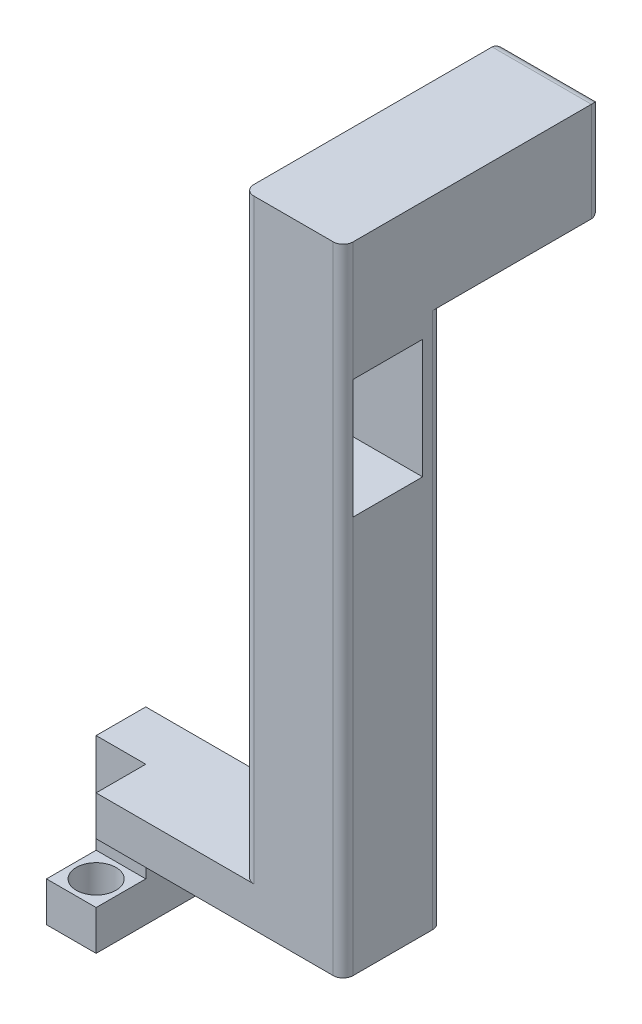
ISO-10303-21;
HEADER;
FILE_DESCRIPTION(('STEP AP214'),'2;1');
FILE_NAME('part.step','',(''),(''),'','','');
FILE_SCHEMA(('AUTOMOTIVE_DESIGN { 1 0 10303 214 1 1 1 1 }'));
ENDSEC;
DATA;
#1=APPLICATION_CONTEXT('core data for automotive mechanical design processes');
#2=APPLICATION_PROTOCOL_DEFINITION('international standard','automotive_design',2000,#1);
#3=PRODUCT_CONTEXT('',#1,'mechanical');
#4=PRODUCT('Part','Part','',(#3));
#5=PRODUCT_RELATED_PRODUCT_CATEGORY('part','',(#4));
#6=PRODUCT_DEFINITION_FORMATION('','',#4);
#7=PRODUCT_DEFINITION_CONTEXT('part definition',#1,'design');
#8=PRODUCT_DEFINITION('design','',#6,#7);
#9=PRODUCT_DEFINITION_SHAPE('','',#8);
#10=(LENGTH_UNIT() NAMED_UNIT(*) SI_UNIT(.MILLI.,.METRE.));
#11=(NAMED_UNIT(*) PLANE_ANGLE_UNIT() SI_UNIT($,.RADIAN.));
#12=(NAMED_UNIT(*) SI_UNIT($,.STERADIAN.) SOLID_ANGLE_UNIT());
#13=UNCERTAINTY_MEASURE_WITH_UNIT(LENGTH_MEASURE(1.E-05),#10,'distance_accuracy_value','');
#14=(GEOMETRIC_REPRESENTATION_CONTEXT(3) GLOBAL_UNCERTAINTY_ASSIGNED_CONTEXT((#13)) GLOBAL_UNIT_ASSIGNED_CONTEXT((#10,
#11,#12)) REPRESENTATION_CONTEXT('',''));
#15=CARTESIAN_POINT('',(0.,0.,0.));
#16=DIRECTION('',(0.,0.,1.));
#17=DIRECTION('',(1.,0.,0.));
#18=AXIS2_PLACEMENT_3D('',#15,#16,#17);
#19=CARTESIAN_POINT('',(-7.47,2.,-2.5));
#20=DIRECTION('',(1.,0.,0.));
#21=DIRECTION('',(0.,0.,-1.));
#22=AXIS2_PLACEMENT_3D('',#19,#20,#21);
#23=PLANE('',#22);
#24=DIRECTION('',(0.,0.,-1.));
#25=VECTOR('',#24,1.);
#26=CARTESIAN_POINT('',(-7.47,-3.,0.));
#27=LINE('',#26,#25);
#28=CARTESIAN_POINT('',(-7.47,-3.,2.5));
#29=VERTEX_POINT('',#28);
#30=CARTESIAN_POINT('',(-7.47,-3.,0.));
#31=VERTEX_POINT('',#30);
#32=EDGE_CURVE('E222',#29,#31,#27,.T.);
#33=ORIENTED_EDGE('',*,*,#32,.T.);
#34=DIRECTION('',(0.,-1.,0.));
#35=VECTOR('',#34,1.);
#36=CARTESIAN_POINT('',(-7.47,0.,0.));
#37=LINE('',#36,#35);
#38=CARTESIAN_POINT('',(-7.47,2.,0.));
#39=VERTEX_POINT('',#38);
#40=EDGE_CURVE('E610',#39,#31,#37,.T.);
#41=ORIENTED_EDGE('',*,*,#40,.F.);
#42=DIRECTION('',(0.,0.,1.));
#43=VECTOR('',#42,1.);
#44=CARTESIAN_POINT('',(-7.47,2.,-2.5));
#45=LINE('',#44,#43);
#46=CARTESIAN_POINT('',(-7.47,2.,-2.5));
#47=VERTEX_POINT('',#46);
#48=EDGE_CURVE('E227',#47,#39,#45,.T.);
#49=ORIENTED_EDGE('',*,*,#48,.F.);
#50=DIRECTION('',(0.,-1.,0.));
#51=VECTOR('',#50,1.);
#52=CARTESIAN_POINT('',(-7.47,2.,-2.5));
#53=LINE('',#52,#51);
#54=CARTESIAN_POINT('',(-7.47,-5.,-2.5));
#55=VERTEX_POINT('',#54);
#56=EDGE_CURVE('E354',#47,#55,#53,.T.);
#57=ORIENTED_EDGE('',*,*,#56,.T.);
#58=DIRECTION('',(0.,0.,-1.));
#59=VECTOR('',#58,1.);
#60=CARTESIAN_POINT('',(-7.47,-5.,0.));
#61=LINE('',#60,#59);
#62=CARTESIAN_POINT('',(-7.47,-5.,2.5));
#63=VERTEX_POINT('',#62);
#64=EDGE_CURVE('E248',#63,#55,#61,.T.);
#65=ORIENTED_EDGE('',*,*,#64,.F.);
#66=DIRECTION('',(0.,-1.,0.));
#67=VECTOR('',#66,1.);
#68=CARTESIAN_POINT('',(-7.47,2.,2.5));
#69=LINE('',#68,#67);
#70=EDGE_CURVE('E343',#29,#63,#69,.T.);
#71=ORIENTED_EDGE('',*,*,#70,.F.);
#72=EDGE_LOOP('',(#33,#41,#49,#57,#65,#71));
#73=FACE_BOUND('',#72,.T.);
#74=ADVANCED_FACE('F45',(#73),#23,.F.);
#75=CARTESIAN_POINT('',(-7.47,2.,2.5));
#76=DIRECTION('',(0.,0.,-1.));
#77=DIRECTION('',(-1.,0.,0.));
#78=AXIS2_PLACEMENT_3D('',#75,#76,#77);
#79=PLANE('',#78);
#80=DIRECTION('',(-1.,0.,0.));
#81=VECTOR('',#80,1.);
#82=CARTESIAN_POINT('',(-4.97,-3.,2.5));
#83=LINE('',#82,#81);
#84=CARTESIAN_POINT('',(-4.97,-3.,2.5));
#85=VERTEX_POINT('',#84);
#86=EDGE_CURVE('E232',#85,#29,#83,.T.);
#87=ORIENTED_EDGE('',*,*,#86,.T.);
#88=ORIENTED_EDGE('',*,*,#70,.T.);
#89=DIRECTION('',(-1.,0.,0.));
#90=VECTOR('',#89,1.);
#91=CARTESIAN_POINT('',(0.,-5.,2.5));
#92=LINE('',#91,#90);
#93=CARTESIAN_POINT('',(-4.97,-5.,2.5));
#94=VERTEX_POINT('',#93);
#95=EDGE_CURVE('E244',#94,#63,#92,.T.);
#96=ORIENTED_EDGE('',*,*,#95,.F.);
#97=DIRECTION('',(0.,1.,0.));
#98=VECTOR('',#97,1.);
#99=CARTESIAN_POINT('',(-4.97,-5.,2.5));
#100=LINE('',#99,#98);
#101=EDGE_CURVE('E252',#94,#85,#100,.T.);
#102=ORIENTED_EDGE('',*,*,#101,.T.);
#103=EDGE_LOOP('',(#87,#88,#96,#102));
#104=FACE_BOUND('',#103,.T.);
#105=ADVANCED_FACE('F530',(#104),#79,.F.);
#106=DIRECTION('',(0.,1.,0.));
#107=VECTOR('',#106,1.);
#108=CARTESIAN_POINT('',(-4.97,0.,2.5));
#109=LINE('',#108,#107);
#110=CARTESIAN_POINT('',(-4.97,0.,2.5));
#111=VERTEX_POINT('',#110);
#112=CARTESIAN_POINT('',(-4.97,2.,2.5));
#113=VERTEX_POINT('',#112);
#114=EDGE_CURVE('E218',#111,#113,#109,.T.);
#115=ORIENTED_EDGE('',*,*,#114,.F.);
#116=DIRECTION('',(1.,0.,0.));
#117=VECTOR('',#116,1.);
#118=CARTESIAN_POINT('',(-7.47,0.,2.5));
#119=LINE('',#118,#117);
#120=CARTESIAN_POINT('',(6.97,0.,2.5));
#121=VERTEX_POINT('',#120);
#122=EDGE_CURVE('E337',#111,#121,#119,.T.);
#123=ORIENTED_EDGE('',*,*,#122,.T.);
#124=DIRECTION('',(0.,-1.,0.));
#125=VECTOR('',#124,1.);
#126=CARTESIAN_POINT('',(6.97,2.,2.5));
#127=LINE('',#126,#125);
#128=CARTESIAN_POINT('',(6.97,32.,2.5));
#129=VERTEX_POINT('',#128);
#130=EDGE_CURVE('E425',#121,#129,#127,.F.);
#131=ORIENTED_EDGE('',*,*,#130,.T.);
#132=DIRECTION('',(1.,0.,0.));
#133=VECTOR('',#132,1.);
#134=CARTESIAN_POINT('',(0.,32.,2.5));
#135=LINE('',#134,#133);
#136=CARTESIAN_POINT('',(2.97,32.,2.5));
#137=VERTEX_POINT('',#136);
#138=EDGE_CURVE('E322',#137,#129,#135,.T.);
#139=ORIENTED_EDGE('',*,*,#138,.F.);
#140=DIRECTION('',(0.,-1.,0.));
#141=VECTOR('',#140,1.);
#142=CARTESIAN_POINT('',(2.97,2.,2.5));
#143=LINE('',#142,#141);
#144=CARTESIAN_POINT('',(2.97,2.,2.5));
#145=VERTEX_POINT('',#144);
#146=EDGE_CURVE('E421',#137,#145,#143,.T.);
#147=ORIENTED_EDGE('',*,*,#146,.T.);
#148=DIRECTION('',(1.,0.,0.));
#149=VECTOR('',#148,1.);
#150=CARTESIAN_POINT('',(-7.47,2.,2.5));
#151=LINE('',#150,#149);
#152=EDGE_CURVE('E340',#113,#145,#151,.T.);
#153=ORIENTED_EDGE('',*,*,#152,.F.);
#154=EDGE_LOOP('',(#115,#123,#131,#139,#147,#153));
#155=FACE_BOUND('',#154,.T.);
#156=ADVANCED_FACE('F497',(#155),#79,.F.);
#157=CARTESIAN_POINT('',(-4.97,-5.,0.));
#158=DIRECTION('',(-1.,0.,0.));
#159=DIRECTION('',(0.,0.,1.));
#160=AXIS2_PLACEMENT_3D('',#157,#158,#159);
#161=PLANE('',#160);
#162=DIRECTION('',(0.,0.,-1.));
#163=VECTOR('',#162,1.);
#164=CARTESIAN_POINT('',(-4.97,-3.,0.));
#165=LINE('',#164,#163);
#166=CARTESIAN_POINT('',(-4.97,-3.,0.));
#167=VERTEX_POINT('',#166);
#168=EDGE_CURVE('E212',#85,#167,#165,.T.);
#169=ORIENTED_EDGE('',*,*,#168,.F.);
#170=ORIENTED_EDGE('',*,*,#101,.F.);
#171=DIRECTION('',(0.,0.,1.));
#172=VECTOR('',#171,1.);
#173=CARTESIAN_POINT('',(-4.97,-5.,0.));
#174=LINE('',#173,#172);
#175=CARTESIAN_POINT('',(-4.97,-5.,-2.5));
#176=VERTEX_POINT('',#175);
#177=EDGE_CURVE('E241',#176,#94,#174,.T.);
#178=ORIENTED_EDGE('',*,*,#177,.F.);
#179=DIRECTION('',(0.,1.,0.));
#180=VECTOR('',#179,1.);
#181=CARTESIAN_POINT('',(-4.97,-5.,-2.5));
#182=LINE('',#181,#180);
#183=CARTESIAN_POINT('',(-4.97,0.,-2.5));
#184=VERTEX_POINT('',#183);
#185=EDGE_CURVE('E259',#176,#184,#182,.T.);
#186=ORIENTED_EDGE('',*,*,#185,.T.);
#187=DIRECTION('',(0.,0.,1.));
#188=VECTOR('',#187,1.);
#189=CARTESIAN_POINT('',(-4.97,0.,0.));
#190=LINE('',#189,#188);
#191=CARTESIAN_POINT('',(-4.97,0.,0.));
#192=VERTEX_POINT('',#191);
#193=EDGE_CURVE('E69',#184,#192,#190,.T.);
#194=ORIENTED_EDGE('',*,*,#193,.T.);
#195=DIRECTION('',(0.,-1.,0.));
#196=VECTOR('',#195,1.);
#197=CARTESIAN_POINT('',(-4.97,-5.,0.));
#198=LINE('',#197,#196);
#199=EDGE_CURVE('E11',#192,#167,#198,.T.);
#200=ORIENTED_EDGE('',*,*,#199,.T.);
#201=EDGE_LOOP('',(#169,#170,#178,#186,#194,#200));
#202=FACE_BOUND('',#201,.T.);
#203=ADVANCED_FACE('F580',(#202),#161,.F.);
#204=CARTESIAN_POINT('',(0.,0.,0.));
#205=DIRECTION('',(0.,1.,0.));
#206=DIRECTION('',(0.,0.,1.));
#207=AXIS2_PLACEMENT_3D('',#204,#205,#206);
#208=PLANE('',#207);
#209=ORIENTED_EDGE('',*,*,#193,.F.);
#210=DIRECTION('',(-1.,0.,0.));
#211=VECTOR('',#210,1.);
#212=CARTESIAN_POINT('',(-7.47,0.,-2.5));
#213=LINE('',#212,#211);
#214=CARTESIAN_POINT('',(6.97,0.,-2.5));
#215=VERTEX_POINT('',#214);
#216=EDGE_CURVE('E347',#215,#184,#213,.T.);
#217=ORIENTED_EDGE('',*,*,#216,.F.);
#218=CARTESIAN_POINT('',(6.97,0.,-2.));
#219=DIRECTION('',(0.,1.,0.));
#220=DIRECTION('',(0.,0.,1.));
#221=AXIS2_PLACEMENT_3D('',#218,#219,#220);
#222=CIRCLE('',#221,0.5);
#223=CARTESIAN_POINT('',(7.47,0.,-2.));
#224=VERTEX_POINT('',#223);
#225=EDGE_CURVE('E418',#215,#224,#222,.F.);
#226=ORIENTED_EDGE('',*,*,#225,.T.);
#227=DIRECTION('',(0.,0.,-1.));
#228=VECTOR('',#227,1.);
#229=CARTESIAN_POINT('',(7.47,0.,-2.5));
#230=LINE('',#229,#228);
#231=CARTESIAN_POINT('',(7.47,0.,2.));
#232=VERTEX_POINT('',#231);
#233=EDGE_CURVE('E330',#232,#224,#230,.T.);
#234=ORIENTED_EDGE('',*,*,#233,.F.);
#235=CARTESIAN_POINT('',(6.97,0.,2.));
#236=DIRECTION('',(0.,1.,0.));
#237=DIRECTION('',(0.,0.,1.));
#238=AXIS2_PLACEMENT_3D('',#235,#236,#237);
#239=CIRCLE('',#238,0.5);
#240=EDGE_CURVE('E414',#232,#121,#239,.F.);
#241=ORIENTED_EDGE('',*,*,#240,.T.);
#242=ORIENTED_EDGE('',*,*,#122,.F.);
#243=EDGE_CURVE('E255',#192,#111,#190,.T.);
#244=ORIENTED_EDGE('',*,*,#243,.F.);
#245=EDGE_LOOP('',(#209,#217,#226,#234,#241,#242,#244));
#246=FACE_BOUND('',#245,.T.);
#247=ADVANCED_FACE('F545',(#246),#208,.F.);
#248=CARTESIAN_POINT('',(7.47,2.,-2.5));
#249=DIRECTION('',(-1.,0.,0.));
#250=DIRECTION('',(0.,0.,1.));
#251=AXIS2_PLACEMENT_3D('',#248,#249,#250);
#252=PLANE('',#251);
#253=DIRECTION('',(0.,0.,1.));
#254=VECTOR('',#253,1.);
#255=CARTESIAN_POINT('',(7.47,26.,-2.5));
#256=LINE('',#255,#254);
#257=CARTESIAN_POINT('',(7.47,26.,-1.5));
#258=VERTEX_POINT('',#257);
#259=CARTESIAN_POINT('',(7.47,26.,2.));
#260=VERTEX_POINT('',#259);
#261=EDGE_CURVE('E298',#258,#260,#256,.T.);
#262=ORIENTED_EDGE('',*,*,#261,.F.);
#263=DIRECTION('',(0.,1.,0.));
#264=VECTOR('',#263,1.);
#265=CARTESIAN_POINT('',(7.47,2.,-1.5));
#266=LINE('',#265,#264);
#267=CARTESIAN_POINT('',(7.47,20.,-1.5));
#268=VERTEX_POINT('',#267);
#269=EDGE_CURVE('E302',#268,#258,#266,.T.);
#270=ORIENTED_EDGE('',*,*,#269,.F.);
#271=DIRECTION('',(0.,0.,1.));
#272=VECTOR('',#271,1.);
#273=CARTESIAN_POINT('',(7.47,20.,-2.5));
#274=LINE('',#273,#272);
#275=CARTESIAN_POINT('',(7.47,20.,2.));
#276=VERTEX_POINT('',#275);
#277=EDGE_CURVE('E282',#268,#276,#274,.T.);
#278=ORIENTED_EDGE('',*,*,#277,.T.);
#279=DIRECTION('',(0.,-1.,0.));
#280=VECTOR('',#279,1.);
#281=CARTESIAN_POINT('',(7.47,2.,2.));
#282=LINE('',#281,#280);
#283=EDGE_CURVE('E395',#276,#232,#282,.T.);
#284=ORIENTED_EDGE('',*,*,#283,.T.);
#285=ORIENTED_EDGE('',*,*,#233,.T.);
#286=DIRECTION('',(0.,-1.,0.));
#287=VECTOR('',#286,1.);
#288=CARTESIAN_POINT('',(7.47,2.,-2.));
#289=LINE('',#288,#287);
#290=CARTESIAN_POINT('',(7.47,27.,-2.));
#291=VERTEX_POINT('',#290);
#292=EDGE_CURVE('E400',#224,#291,#289,.F.);
#293=ORIENTED_EDGE('',*,*,#292,.T.);
#294=DIRECTION('',(0.,0.,1.));
#295=VECTOR('',#294,1.);
#296=CARTESIAN_POINT('',(7.47,27.,-10.5));
#297=LINE('',#296,#295);
#298=CARTESIAN_POINT('',(7.47,27.,-10.));
#299=VERTEX_POINT('',#298);
#300=EDGE_CURVE('E314',#299,#291,#297,.T.);
#301=ORIENTED_EDGE('',*,*,#300,.F.);
#302=DIRECTION('',(0.,-1.,0.));
#303=VECTOR('',#302,1.);
#304=CARTESIAN_POINT('',(7.47,32.,-10.));
#305=LINE('',#304,#303);
#306=CARTESIAN_POINT('',(7.47,32.,-10.));
#307=VERTEX_POINT('',#306);
#308=EDGE_CURVE('E404',#299,#307,#305,.F.);
#309=ORIENTED_EDGE('',*,*,#308,.T.);
#310=DIRECTION('',(0.,0.,-1.));
#311=VECTOR('',#310,1.);
#312=CARTESIAN_POINT('',(7.47,32.,0.));
#313=LINE('',#312,#311);
#314=CARTESIAN_POINT('',(7.47,32.,2.));
#315=VERTEX_POINT('',#314);
#316=EDGE_CURVE('E326',#315,#307,#313,.T.);
#317=ORIENTED_EDGE('',*,*,#316,.F.);
#318=EDGE_CURVE('E396',#315,#260,#282,.T.);
#319=ORIENTED_EDGE('',*,*,#318,.T.);
#320=EDGE_LOOP('',(#262,#270,#278,#284,#285,#293,#301,#309,#317,#319));
#321=FACE_BOUND('',#320,.T.);
#322=ADVANCED_FACE('F469',(#321),#252,.F.);
#323=CARTESIAN_POINT('',(2.47,32.,0.));
#324=DIRECTION('',(-1.,0.,0.));
#325=DIRECTION('',(0.,0.,1.));
#326=AXIS2_PLACEMENT_3D('',#323,#324,#325);
#327=PLANE('',#326);
#328=DIRECTION('',(0.,1.,0.));
#329=VECTOR('',#328,1.);
#330=CARTESIAN_POINT('',(2.47,0.,-1.5));
#331=LINE('',#330,#329);
#332=CARTESIAN_POINT('',(2.47,20.,-1.5));
#333=VERTEX_POINT('',#332);
#334=CARTESIAN_POINT('',(2.47,26.,-1.5));
#335=VERTEX_POINT('',#334);
#336=EDGE_CURVE('E267',#333,#335,#331,.T.);
#337=ORIENTED_EDGE('',*,*,#336,.T.);
#338=DIRECTION('',(0.,0.,1.));
#339=VECTOR('',#338,1.);
#340=CARTESIAN_POINT('',(2.47,26.,0.));
#341=LINE('',#340,#339);
#342=CARTESIAN_POINT('',(2.47,26.,2.));
#343=VERTEX_POINT('',#342);
#344=EDGE_CURVE('E263',#335,#343,#341,.T.);
#345=ORIENTED_EDGE('',*,*,#344,.T.);
#346=DIRECTION('',(0.,-1.,0.));
#347=VECTOR('',#346,1.);
#348=CARTESIAN_POINT('',(2.47,32.,2.));
#349=LINE('',#348,#347);
#350=CARTESIAN_POINT('',(2.47,32.,2.));
#351=VERTEX_POINT('',#350);
#352=EDGE_CURVE('E380',#343,#351,#349,.F.);
#353=ORIENTED_EDGE('',*,*,#352,.T.);
#354=DIRECTION('',(0.,0.,-1.));
#355=VECTOR('',#354,1.);
#356=CARTESIAN_POINT('',(2.47,32.,0.));
#357=LINE('',#356,#355);
#358=CARTESIAN_POINT('',(2.47,32.,-10.));
#359=VERTEX_POINT('',#358);
#360=EDGE_CURVE('E318',#351,#359,#357,.T.);
#361=ORIENTED_EDGE('',*,*,#360,.T.);
#362=DIRECTION('',(0.,1.,0.));
#363=VECTOR('',#362,1.);
#364=CARTESIAN_POINT('',(2.47,32.,-10.));
#365=LINE('',#364,#363);
#366=CARTESIAN_POINT('',(2.47,27.,-10.));
#367=VERTEX_POINT('',#366);
#368=EDGE_CURVE('E389',#359,#367,#365,.F.);
#369=ORIENTED_EDGE('',*,*,#368,.T.);
#370=DIRECTION('',(0.,0.,1.));
#371=VECTOR('',#370,1.);
#372=CARTESIAN_POINT('',(2.47,27.,-10.5));
#373=LINE('',#372,#371);
#374=CARTESIAN_POINT('',(2.47,27.,-2.));
#375=VERTEX_POINT('',#374);
#376=EDGE_CURVE('E310',#367,#375,#373,.T.);
#377=ORIENTED_EDGE('',*,*,#376,.T.);
#378=DIRECTION('',(0.,-1.,0.));
#379=VECTOR('',#378,1.);
#380=CARTESIAN_POINT('',(2.47,2.,-2.));
#381=LINE('',#380,#379);
#382=CARTESIAN_POINT('',(2.47,2.,-2.));
#383=VERTEX_POINT('',#382);
#384=EDGE_CURVE('E385',#375,#383,#381,.T.);
#385=ORIENTED_EDGE('',*,*,#384,.T.);
#386=DIRECTION('',(0.,0.,-1.));
#387=VECTOR('',#386,1.);
#388=CARTESIAN_POINT('',(2.47,2.,0.));
#389=LINE('',#388,#387);
#390=CARTESIAN_POINT('',(2.47,2.,2.));
#391=VERTEX_POINT('',#390);
#392=EDGE_CURVE('E317',#391,#383,#389,.T.);
#393=ORIENTED_EDGE('',*,*,#392,.F.);
#394=CARTESIAN_POINT('',(2.47,20.,2.));
#395=VERTEX_POINT('',#394);
#396=EDGE_CURVE('E381',#391,#395,#349,.F.);
#397=ORIENTED_EDGE('',*,*,#396,.T.);
#398=DIRECTION('',(0.,0.,1.));
#399=VECTOR('',#398,1.);
#400=CARTESIAN_POINT('',(2.47,20.,0.));
#401=LINE('',#400,#399);
#402=EDGE_CURVE('E271',#333,#395,#401,.T.);
#403=ORIENTED_EDGE('',*,*,#402,.F.);
#404=EDGE_LOOP('',(#337,#345,#353,#361,#369,#377,#385,#393,#397,#403));
#405=FACE_BOUND('',#404,.T.);
#406=ADVANCED_FACE('F488',(#405),#327,.T.);
#407=CARTESIAN_POINT('',(-7.47,2.,-2.5));
#408=DIRECTION('',(0.,0.,1.));
#409=DIRECTION('',(1.,0.,0.));
#410=AXIS2_PLACEMENT_3D('',#407,#408,#409);
#411=PLANE('',#410);
#412=DIRECTION('',(-1.,0.,0.));
#413=VECTOR('',#412,1.);
#414=CARTESIAN_POINT('',(0.,27.,-2.5));
#415=LINE('',#414,#413);
#416=CARTESIAN_POINT('',(6.97,27.,-2.5));
#417=VERTEX_POINT('',#416);
#418=CARTESIAN_POINT('',(2.97,27.,-2.5));
#419=VERTEX_POINT('',#418);
#420=EDGE_CURVE('E306',#417,#419,#415,.T.);
#421=ORIENTED_EDGE('',*,*,#420,.F.);
#422=DIRECTION('',(0.,-1.,0.));
#423=VECTOR('',#422,1.);
#424=CARTESIAN_POINT('',(6.97,2.,-2.5));
#425=LINE('',#424,#423);
#426=EDGE_CURVE('E410',#417,#215,#425,.T.);
#427=ORIENTED_EDGE('',*,*,#426,.T.);
#428=ORIENTED_EDGE('',*,*,#216,.T.);
#429=ORIENTED_EDGE('',*,*,#185,.F.);
#430=DIRECTION('',(1.,0.,0.));
#431=VECTOR('',#430,1.);
#432=CARTESIAN_POINT('',(0.,-5.,-2.5));
#433=LINE('',#432,#431);
#434=EDGE_CURVE('E237',#55,#176,#433,.T.);
#435=ORIENTED_EDGE('',*,*,#434,.F.);
#436=ORIENTED_EDGE('',*,*,#56,.F.);
#437=DIRECTION('',(-1.,0.,0.));
#438=VECTOR('',#437,1.);
#439=CARTESIAN_POINT('',(-7.47,2.,-2.5));
#440=LINE('',#439,#438);
#441=CARTESIAN_POINT('',(2.97,2.,-2.5));
#442=VERTEX_POINT('',#441);
#443=EDGE_CURVE('E334',#442,#47,#440,.T.);
#444=ORIENTED_EDGE('',*,*,#443,.F.);
#445=DIRECTION('',(0.,-1.,0.));
#446=VECTOR('',#445,1.);
#447=CARTESIAN_POINT('',(2.97,27.,-2.5));
#448=LINE('',#447,#446);
#449=EDGE_CURVE('E407',#442,#419,#448,.F.);
#450=ORIENTED_EDGE('',*,*,#449,.T.);
#451=EDGE_LOOP('',(#421,#427,#428,#429,#435,#436,#444,#450));
#452=FACE_BOUND('',#451,.T.);
#453=ADVANCED_FACE('F480',(#452),#411,.F.);
#454=CARTESIAN_POINT('',(0.,2.,0.));
#455=DIRECTION('',(0.,1.,0.));
#456=DIRECTION('',(0.,0.,1.));
#457=AXIS2_PLACEMENT_3D('',#454,#455,#456);
#458=PLANE('',#457);
#459=DIRECTION('',(-1.,0.,0.));
#460=VECTOR('',#459,1.);
#461=CARTESIAN_POINT('',(-4.97,2.,0.));
#462=LINE('',#461,#460);
#463=CARTESIAN_POINT('',(-4.97,2.,0.));
#464=VERTEX_POINT('',#463);
#465=EDGE_CURVE('E208',#464,#39,#462,.T.);
#466=ORIENTED_EDGE('',*,*,#465,.F.);
#467=DIRECTION('',(0.,0.,-1.));
#468=VECTOR('',#467,1.);
#469=CARTESIAN_POINT('',(-4.97,2.,0.));
#470=LINE('',#469,#468);
#471=EDGE_CURVE('E213',#113,#464,#470,.T.);
#472=ORIENTED_EDGE('',*,*,#471,.F.);
#473=ORIENTED_EDGE('',*,*,#152,.T.);
#474=CARTESIAN_POINT('',(2.97,2.,2.));
#475=DIRECTION('',(0.,1.,0.));
#476=DIRECTION('',(0.,0.,1.));
#477=AXIS2_PLACEMENT_3D('',#474,#475,#476);
#478=CIRCLE('',#477,0.5);
#479=EDGE_CURVE('E54',#145,#391,#478,.F.);
#480=ORIENTED_EDGE('',*,*,#479,.T.);
#481=ORIENTED_EDGE('',*,*,#392,.T.);
#482=CARTESIAN_POINT('',(2.97,2.,-2.));
#483=DIRECTION('',(0.,1.,0.));
#484=DIRECTION('',(0.,0.,1.));
#485=AXIS2_PLACEMENT_3D('',#482,#483,#484);
#486=CIRCLE('',#485,0.5);
#487=EDGE_CURVE('E431',#383,#442,#486,.F.);
#488=ORIENTED_EDGE('',*,*,#487,.T.);
#489=ORIENTED_EDGE('',*,*,#443,.T.);
#490=ORIENTED_EDGE('',*,*,#48,.T.);
#491=EDGE_LOOP('',(#466,#472,#473,#480,#481,#488,#489,#490));
#492=FACE_BOUND('',#491,.T.);
#493=ADVANCED_FACE('F225',(#492),#458,.T.);
#494=CARTESIAN_POINT('',(0.,32.,0.));
#495=DIRECTION('',(0.,1.,0.));
#496=DIRECTION('',(0.,0.,1.));
#497=AXIS2_PLACEMENT_3D('',#494,#495,#496);
#498=PLANE('',#497);
#499=ORIENTED_EDGE('',*,*,#316,.T.);
#500=DIRECTION('',(1.,0.,0.));
#501=VECTOR('',#500,1.);
#502=CARTESIAN_POINT('',(0.,32.,-10.));
#503=LINE('',#502,#501);
#504=EDGE_CURVE('E376',#307,#359,#503,.F.);
#505=ORIENTED_EDGE('',*,*,#504,.T.);
#506=ORIENTED_EDGE('',*,*,#360,.F.);
#507=CARTESIAN_POINT('',(2.97,32.,2.));
#508=DIRECTION('',(0.,1.,0.));
#509=DIRECTION('',(0.,0.,1.));
#510=AXIS2_PLACEMENT_3D('',#507,#508,#509);
#511=CIRCLE('',#510,0.5);
#512=EDGE_CURVE('E370',#351,#137,#511,.T.);
#513=ORIENTED_EDGE('',*,*,#512,.T.);
#514=ORIENTED_EDGE('',*,*,#138,.T.);
#515=CARTESIAN_POINT('',(6.97,32.,2.));
#516=DIRECTION('',(0.,1.,0.));
#517=DIRECTION('',(0.,0.,1.));
#518=AXIS2_PLACEMENT_3D('',#515,#516,#517);
#519=CIRCLE('',#518,0.5);
#520=EDGE_CURVE('E373',#129,#315,#519,.T.);
#521=ORIENTED_EDGE('',*,*,#520,.T.);
#522=EDGE_LOOP('',(#499,#505,#506,#513,#514,#521));
#523=FACE_BOUND('',#522,.T.);
#524=ADVANCED_FACE('F501',(#523),#498,.T.);
#525=CARTESIAN_POINT('',(0.,27.,-10.5));
#526=DIRECTION('',(0.,1.,0.));
#527=DIRECTION('',(0.,0.,1.));
#528=AXIS2_PLACEMENT_3D('',#525,#526,#527);
#529=PLANE('',#528);
#530=ORIENTED_EDGE('',*,*,#376,.F.);
#531=DIRECTION('',(-1.,0.,0.));
#532=VECTOR('',#531,1.);
#533=CARTESIAN_POINT('',(7.47,27.,-10.));
#534=LINE('',#533,#532);
#535=EDGE_CURVE('E392',#367,#299,#534,.F.);
#536=ORIENTED_EDGE('',*,*,#535,.T.);
#537=ORIENTED_EDGE('',*,*,#300,.T.);
#538=CARTESIAN_POINT('',(6.97,27.,-2.));
#539=DIRECTION('',(0.,1.,0.));
#540=DIRECTION('',(0.,0.,1.));
#541=AXIS2_PLACEMENT_3D('',#538,#539,#540);
#542=CIRCLE('',#541,0.5);
#543=EDGE_CURVE('E428',#291,#417,#542,.T.);
#544=ORIENTED_EDGE('',*,*,#543,.T.);
#545=ORIENTED_EDGE('',*,*,#420,.T.);
#546=CARTESIAN_POINT('',(2.97,27.,-2.));
#547=DIRECTION('',(0.,1.,0.));
#548=DIRECTION('',(0.,0.,1.));
#549=AXIS2_PLACEMENT_3D('',#546,#547,#548);
#550=CIRCLE('',#549,0.5);
#551=EDGE_CURVE('E435',#419,#375,#550,.T.);
#552=ORIENTED_EDGE('',*,*,#551,.T.);
#553=EDGE_LOOP('',(#530,#536,#537,#544,#545,#552));
#554=FACE_BOUND('',#553,.T.);
#555=ADVANCED_FACE('F466',(#554),#529,.F.);
#556=CARTESIAN_POINT('',(0.,0.,-10.5));
#557=DIRECTION('',(0.,0.,-1.));
#558=DIRECTION('',(-1.,0.,0.));
#559=AXIS2_PLACEMENT_3D('',#556,#557,#558);
#560=PLANE('',#559);
#561=DIRECTION('',(0.,1.,0.));
#562=VECTOR('',#561,1.);
#563=CARTESIAN_POINT('',(2.97,0.,-10.5));
#564=LINE('',#563,#562);
#565=CARTESIAN_POINT('',(2.97,27.5,-10.5));
#566=VERTEX_POINT('',#565);
#567=CARTESIAN_POINT('',(2.97,31.5,-10.5));
#568=VERTEX_POINT('',#567);
#569=EDGE_CURVE('E363',#566,#568,#564,.T.);
#570=ORIENTED_EDGE('',*,*,#569,.T.);
#571=DIRECTION('',(1.,0.,0.));
#572=VECTOR('',#571,1.);
#573=CARTESIAN_POINT('',(0.,31.5,-10.5));
#574=LINE('',#573,#572);
#575=CARTESIAN_POINT('',(6.97,31.5,-10.5));
#576=VERTEX_POINT('',#575);
#577=EDGE_CURVE('E366',#568,#576,#574,.T.);
#578=ORIENTED_EDGE('',*,*,#577,.T.);
#579=DIRECTION('',(0.,-1.,0.));
#580=VECTOR('',#579,1.);
#581=CARTESIAN_POINT('',(6.97,27.,-10.5));
#582=LINE('',#581,#580);
#583=CARTESIAN_POINT('',(6.97,27.5,-10.5));
#584=VERTEX_POINT('',#583);
#585=EDGE_CURVE('E357',#576,#584,#582,.T.);
#586=ORIENTED_EDGE('',*,*,#585,.T.);
#587=DIRECTION('',(-1.,0.,0.));
#588=VECTOR('',#587,1.);
#589=CARTESIAN_POINT('',(2.47,27.5,-10.5));
#590=LINE('',#589,#588);
#591=EDGE_CURVE('E360',#584,#566,#590,.T.);
#592=ORIENTED_EDGE('',*,*,#591,.T.);
#593=EDGE_LOOP('',(#570,#578,#586,#592));
#594=FACE_BOUND('',#593,.T.);
#595=ADVANCED_FACE('F519',(#594),#560,.T.);
#596=CARTESIAN_POINT('',(0.,27.5,-10.));
#597=DIRECTION('',(1.,0.,0.));
#598=DIRECTION('',(0.,0.,-1.));
#599=AXIS2_PLACEMENT_3D('',#596,#597,#598);
#600=CYLINDRICAL_SURFACE('',#599,0.5);
#601=CARTESIAN_POINT('',(6.97,27.5,-10.));
#602=DIRECTION('',(0.707106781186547,0.707106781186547,0.));
#603=DIRECTION('',(-0.707106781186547,0.707106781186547,0.));
#604=AXIS2_PLACEMENT_3D('',#601,#602,#603);
#605=ELLIPSE('',#604,0.707106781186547,0.5);
#606=EDGE_CURVE('E446',#299,#584,#605,.T.);
#607=ORIENTED_EDGE('',*,*,#606,.F.);
#608=ORIENTED_EDGE('',*,*,#535,.F.);
#609=CARTESIAN_POINT('',(2.97,27.5,-10.));
#610=DIRECTION('',(0.707106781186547,-0.707106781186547,0.));
#611=DIRECTION('',(0.707106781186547,0.707106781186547,0.));
#612=AXIS2_PLACEMENT_3D('',#609,#610,#611);
#613=ELLIPSE('',#612,0.707106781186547,0.5);
#614=EDGE_CURVE('E311',#566,#367,#613,.F.);
#615=ORIENTED_EDGE('',*,*,#614,.F.);
#616=ORIENTED_EDGE('',*,*,#591,.F.);
#617=EDGE_LOOP('',(#607,#608,#615,#616));
#618=FACE_BOUND('',#617,.T.);
#619=ADVANCED_FACE('F461',(#618),#600,.T.);
#620=CARTESIAN_POINT('',(2.97,0.,-10.));
#621=DIRECTION('',(0.,1.,0.));
#622=DIRECTION('',(0.,0.,1.));
#623=AXIS2_PLACEMENT_3D('',#620,#621,#622);
#624=CYLINDRICAL_SURFACE('',#623,0.5);
#625=ORIENTED_EDGE('',*,*,#614,.T.);
#626=ORIENTED_EDGE('',*,*,#368,.F.);
#627=CARTESIAN_POINT('',(2.97,31.5,-10.));
#628=DIRECTION('',(0.707106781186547,0.707106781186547,0.));
#629=DIRECTION('',(-0.707106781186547,0.707106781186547,0.));
#630=AXIS2_PLACEMENT_3D('',#627,#628,#629);
#631=ELLIPSE('',#630,0.707106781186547,0.5);
#632=EDGE_CURVE('E443',#568,#359,#631,.T.);
#633=ORIENTED_EDGE('',*,*,#632,.F.);
#634=ORIENTED_EDGE('',*,*,#569,.F.);
#635=EDGE_LOOP('',(#625,#626,#633,#634));
#636=FACE_BOUND('',#635,.T.);
#637=ADVANCED_FACE('F455',(#636),#624,.T.);
#638=CARTESIAN_POINT('',(6.97,0.,-10.));
#639=DIRECTION('',(0.,1.,0.));
#640=DIRECTION('',(0.,0.,1.));
#641=AXIS2_PLACEMENT_3D('',#638,#639,#640);
#642=CYLINDRICAL_SURFACE('',#641,0.5);
#643=ORIENTED_EDGE('',*,*,#606,.T.);
#644=ORIENTED_EDGE('',*,*,#585,.F.);
#645=CARTESIAN_POINT('',(6.97,31.5,-10.));
#646=DIRECTION('',(-0.707106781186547,0.707106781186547,0.));
#647=DIRECTION('',(0.707106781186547,0.707106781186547,0.));
#648=AXIS2_PLACEMENT_3D('',#645,#646,#647);
#649=ELLIPSE('',#648,0.707106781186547,0.5);
#650=EDGE_CURVE('E305',#307,#576,#649,.T.);
#651=ORIENTED_EDGE('',*,*,#650,.F.);
#652=ORIENTED_EDGE('',*,*,#308,.F.);
#653=EDGE_LOOP('',(#643,#644,#651,#652));
#654=FACE_BOUND('',#653,.T.);
#655=ADVANCED_FACE('F517',(#654),#642,.T.);
#656=CARTESIAN_POINT('',(0.,31.5,-10.));
#657=DIRECTION('',(1.,0.,0.));
#658=DIRECTION('',(0.,0.,-1.));
#659=AXIS2_PLACEMENT_3D('',#656,#657,#658);
#660=CYLINDRICAL_SURFACE('',#659,0.5);
#661=ORIENTED_EDGE('',*,*,#632,.T.);
#662=ORIENTED_EDGE('',*,*,#504,.F.);
#663=ORIENTED_EDGE('',*,*,#650,.T.);
#664=ORIENTED_EDGE('',*,*,#577,.F.);
#665=EDGE_LOOP('',(#661,#662,#663,#664));
#666=FACE_BOUND('',#665,.T.);
#667=ADVANCED_FACE('F513',(#666),#660,.T.);
#668=CARTESIAN_POINT('',(6.97,2.,-2.));
#669=DIRECTION('',(0.,-1.,0.));
#670=DIRECTION('',(0.,0.,-1.));
#671=AXIS2_PLACEMENT_3D('',#668,#669,#670);
#672=CYLINDRICAL_SURFACE('',#671,0.5);
#673=ORIENTED_EDGE('',*,*,#543,.F.);
#674=ORIENTED_EDGE('',*,*,#292,.F.);
#675=ORIENTED_EDGE('',*,*,#225,.F.);
#676=ORIENTED_EDGE('',*,*,#426,.F.);
#677=EDGE_LOOP('',(#673,#674,#675,#676));
#678=FACE_BOUND('',#677,.T.);
#679=ADVANCED_FACE('F476',(#678),#672,.T.);
#680=CARTESIAN_POINT('',(2.97,32.,-2.));
#681=DIRECTION('',(0.,1.,0.));
#682=DIRECTION('',(0.,0.,1.));
#683=AXIS2_PLACEMENT_3D('',#680,#681,#682);
#684=CYLINDRICAL_SURFACE('',#683,0.5);
#685=ORIENTED_EDGE('',*,*,#551,.F.);
#686=ORIENTED_EDGE('',*,*,#449,.F.);
#687=ORIENTED_EDGE('',*,*,#487,.F.);
#688=ORIENTED_EDGE('',*,*,#384,.F.);
#689=EDGE_LOOP('',(#685,#686,#687,#688));
#690=FACE_BOUND('',#689,.T.);
#691=ADVANCED_FACE('F484',(#690),#684,.T.);
#692=CARTESIAN_POINT('',(6.97,2.,2.));
#693=DIRECTION('',(0.,-1.,0.));
#694=DIRECTION('',(0.,0.,-1.));
#695=AXIS2_PLACEMENT_3D('',#692,#693,#694);
#696=CYLINDRICAL_SURFACE('',#695,0.5);
#697=ORIENTED_EDGE('',*,*,#520,.F.);
#698=ORIENTED_EDGE('',*,*,#130,.F.);
#699=ORIENTED_EDGE('',*,*,#240,.F.);
#700=ORIENTED_EDGE('',*,*,#283,.F.);
#701=DIRECTION('',(0.,-1.,0.));
#702=VECTOR('',#701,1.);
#703=CARTESIAN_POINT('',(7.47,2.,2.));
#704=LINE('',#703,#702);
#705=EDGE_CURVE('E295',#260,#276,#704,.T.);
#706=ORIENTED_EDGE('',*,*,#705,.F.);
#707=ORIENTED_EDGE('',*,*,#318,.F.);
#708=EDGE_LOOP('',(#697,#698,#699,#700,#706,#707));
#709=FACE_BOUND('',#708,.T.);
#710=ADVANCED_FACE('F505',(#709),#696,.T.);
#711=CARTESIAN_POINT('',(2.97,2.,2.));
#712=DIRECTION('',(0.,1.,0.));
#713=DIRECTION('',(0.,0.,1.));
#714=AXIS2_PLACEMENT_3D('',#711,#712,#713);
#715=CYLINDRICAL_SURFACE('',#714,0.5);
#716=ORIENTED_EDGE('',*,*,#512,.F.);
#717=ORIENTED_EDGE('',*,*,#352,.F.);
#718=DIRECTION('',(0.,1.,0.));
#719=VECTOR('',#718,1.);
#720=CARTESIAN_POINT('',(2.47,0.,2.));
#721=LINE('',#720,#719);
#722=EDGE_CURVE('E274',#395,#343,#721,.T.);
#723=ORIENTED_EDGE('',*,*,#722,.F.);
#724=ORIENTED_EDGE('',*,*,#396,.F.);
#725=ORIENTED_EDGE('',*,*,#479,.F.);
#726=ORIENTED_EDGE('',*,*,#146,.F.);
#727=EDGE_LOOP('',(#716,#717,#723,#724,#725,#726));
#728=FACE_BOUND('',#727,.T.);
#729=ADVANCED_FACE('F47',(#728),#715,.T.);
#730=CARTESIAN_POINT('',(10.47,0.,-1.5));
#731=DIRECTION('',(0.,0.,1.));
#732=DIRECTION('',(1.,0.,0.));
#733=AXIS2_PLACEMENT_3D('',#730,#731,#732);
#734=PLANE('',#733);
#735=ORIENTED_EDGE('',*,*,#269,.T.);
#736=DIRECTION('',(-1.,0.,0.));
#737=VECTOR('',#736,1.);
#738=CARTESIAN_POINT('',(10.47,26.,-1.5));
#739=LINE('',#738,#737);
#740=EDGE_CURVE('E278',#258,#335,#739,.T.);
#741=ORIENTED_EDGE('',*,*,#740,.T.);
#742=ORIENTED_EDGE('',*,*,#336,.F.);
#743=DIRECTION('',(-1.,0.,0.));
#744=VECTOR('',#743,1.);
#745=CARTESIAN_POINT('',(10.47,20.,-1.5));
#746=LINE('',#745,#744);
#747=EDGE_CURVE('E287',#268,#333,#746,.T.);
#748=ORIENTED_EDGE('',*,*,#747,.F.);
#749=EDGE_LOOP('',(#735,#741,#742,#748));
#750=FACE_BOUND('',#749,.T.);
#751=ADVANCED_FACE('F559',(#750),#734,.T.);
#752=CARTESIAN_POINT('',(10.47,26.,0.));
#753=DIRECTION('',(0.,-1.,0.));
#754=DIRECTION('',(0.,0.,-1.));
#755=AXIS2_PLACEMENT_3D('',#752,#753,#754);
#756=PLANE('',#755);
#757=ORIENTED_EDGE('',*,*,#261,.T.);
#758=DIRECTION('',(-1.,0.,0.));
#759=VECTOR('',#758,1.);
#760=CARTESIAN_POINT('',(10.47,26.,2.));
#761=LINE('',#760,#759);
#762=EDGE_CURVE('E279',#260,#343,#761,.T.);
#763=ORIENTED_EDGE('',*,*,#762,.T.);
#764=ORIENTED_EDGE('',*,*,#344,.F.);
#765=ORIENTED_EDGE('',*,*,#740,.F.);
#766=EDGE_LOOP('',(#757,#763,#764,#765));
#767=FACE_BOUND('',#766,.T.);
#768=ADVANCED_FACE('F563',(#767),#756,.T.);
#769=CARTESIAN_POINT('',(10.47,20.,0.));
#770=DIRECTION('',(0.,-1.,0.));
#771=DIRECTION('',(0.,0.,-1.));
#772=AXIS2_PLACEMENT_3D('',#769,#770,#771);
#773=PLANE('',#772);
#774=ORIENTED_EDGE('',*,*,#747,.T.);
#775=ORIENTED_EDGE('',*,*,#402,.T.);
#776=DIRECTION('',(-1.,0.,0.));
#777=VECTOR('',#776,1.);
#778=CARTESIAN_POINT('',(10.47,20.,2.));
#779=LINE('',#778,#777);
#780=EDGE_CURVE('E283',#276,#395,#779,.T.);
#781=ORIENTED_EDGE('',*,*,#780,.F.);
#782=ORIENTED_EDGE('',*,*,#277,.F.);
#783=EDGE_LOOP('',(#774,#775,#781,#782));
#784=FACE_BOUND('',#783,.T.);
#785=ADVANCED_FACE('F569',(#784),#773,.F.);
#786=CARTESIAN_POINT('',(10.47,0.,2.));
#787=DIRECTION('',(0.,0.,1.));
#788=DIRECTION('',(1.,0.,0.));
#789=AXIS2_PLACEMENT_3D('',#786,#787,#788);
#790=PLANE('',#789);
#791=ORIENTED_EDGE('',*,*,#705,.T.);
#792=ORIENTED_EDGE('',*,*,#780,.T.);
#793=ORIENTED_EDGE('',*,*,#722,.T.);
#794=ORIENTED_EDGE('',*,*,#762,.F.);
#795=EDGE_LOOP('',(#791,#792,#793,#794));
#796=FACE_BOUND('',#795,.T.);
#797=ADVANCED_FACE('F574',(#796),#790,.F.);
#798=CARTESIAN_POINT('',(0.,-5.,0.));
#799=DIRECTION('',(0.,-1.,0.));
#800=DIRECTION('',(0.,0.,-1.));
#801=AXIS2_PLACEMENT_3D('',#798,#799,#800);
#802=PLANE('',#801);
#803=CARTESIAN_POINT('',(-6.22,-5.,1.25));
#804=DIRECTION('',(0.,-1.,0.));
#805=DIRECTION('',(0.,0.,-1.));
#806=AXIS2_PLACEMENT_3D('',#803,#804,#805);
#807=CIRCLE('',#806,1.);
#808=CARTESIAN_POINT('',(-6.22,-5.,0.250000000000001));
#809=VERTEX_POINT('',#808);
#810=EDGE_CURVE('E603',#809,#809,#807,.T.);
#811=ORIENTED_EDGE('',*,*,#810,.F.);
#812=EDGE_LOOP('',(#811));
#813=FACE_BOUND('',#812,.T.);
#814=ORIENTED_EDGE('',*,*,#434,.T.);
#815=ORIENTED_EDGE('',*,*,#177,.T.);
#816=ORIENTED_EDGE('',*,*,#95,.T.);
#817=ORIENTED_EDGE('',*,*,#64,.T.);
#818=EDGE_LOOP('',(#814,#815,#816,#817));
#819=FACE_BOUND('',#818,.T.);
#820=ADVANCED_FACE('F578',(#813,#819),#802,.T.);
#821=CARTESIAN_POINT('',(-4.97,0.,0.));
#822=DIRECTION('',(-1.,0.,0.));
#823=DIRECTION('',(0.,0.,1.));
#824=AXIS2_PLACEMENT_3D('',#821,#822,#823);
#825=PLANE('',#824);
#826=ORIENTED_EDGE('',*,*,#243,.T.);
#827=ORIENTED_EDGE('',*,*,#114,.T.);
#828=ORIENTED_EDGE('',*,*,#471,.T.);
#829=DIRECTION('',(0.,-1.,0.));
#830=VECTOR('',#829,1.);
#831=CARTESIAN_POINT('',(-4.97,0.,0.));
#832=LINE('',#831,#830);
#833=EDGE_CURVE('E204',#464,#192,#832,.T.);
#834=ORIENTED_EDGE('',*,*,#833,.T.);
#835=EDGE_LOOP('',(#826,#827,#828,#834));
#836=FACE_BOUND('',#835,.T.);
#837=ADVANCED_FACE('F216',(#836),#825,.T.);
#838=CARTESIAN_POINT('',(-4.97,-3.,0.));
#839=DIRECTION('',(0.,1.,0.));
#840=DIRECTION('',(0.,0.,1.));
#841=AXIS2_PLACEMENT_3D('',#838,#839,#840);
#842=PLANE('',#841);
#843=CARTESIAN_POINT('',(-6.22,-3.,1.25));
#844=DIRECTION('',(0.,1.,0.));
#845=DIRECTION('',(0.,0.,1.));
#846=AXIS2_PLACEMENT_3D('',#843,#844,#845);
#847=CIRCLE('',#846,1.);
#848=CARTESIAN_POINT('',(-6.22,-3.,2.25));
#849=VERTEX_POINT('',#848);
#850=EDGE_CURVE('E606',#849,#849,#847,.T.);
#851=ORIENTED_EDGE('',*,*,#850,.F.);
#852=EDGE_LOOP('',(#851));
#853=FACE_BOUND('',#852,.T.);
#854=ORIENTED_EDGE('',*,*,#32,.F.);
#855=ORIENTED_EDGE('',*,*,#86,.F.);
#856=ORIENTED_EDGE('',*,*,#168,.T.);
#857=DIRECTION('',(-1.,0.,0.));
#858=VECTOR('',#857,1.);
#859=CARTESIAN_POINT('',(-4.97,-3.,0.));
#860=LINE('',#859,#858);
#861=EDGE_CURVE('E61',#167,#31,#860,.T.);
#862=ORIENTED_EDGE('',*,*,#861,.T.);
#863=EDGE_LOOP('',(#854,#855,#856,#862));
#864=FACE_BOUND('',#863,.T.);
#865=ADVANCED_FACE('F590',(#853,#864),#842,.T.);
#866=CARTESIAN_POINT('',(-4.97,0.,0.));
#867=DIRECTION('',(0.,0.,-1.));
#868=DIRECTION('',(0.,1.,0.));
#869=AXIS2_PLACEMENT_3D('',#866,#867,#868);
#870=PLANE('',#869);
#871=ORIENTED_EDGE('',*,*,#40,.T.);
#872=ORIENTED_EDGE('',*,*,#861,.F.);
#873=ORIENTED_EDGE('',*,*,#199,.F.);
#874=ORIENTED_EDGE('',*,*,#833,.F.);
#875=ORIENTED_EDGE('',*,*,#465,.T.);
#876=EDGE_LOOP('',(#871,#872,#873,#874,#875));
#877=FACE_BOUND('',#876,.T.);
#878=ADVANCED_FACE('F206',(#877),#870,.F.);
#879=CARTESIAN_POINT('',(-6.22,-5.5,1.25));
#880=DIRECTION('',(0.,1.,0.));
#881=DIRECTION('',(0.,0.,1.));
#882=AXIS2_PLACEMENT_3D('',#879,#880,#881);
#883=CYLINDRICAL_SURFACE('',#882,1.);
#884=ORIENTED_EDGE('',*,*,#810,.T.);
#885=EDGE_LOOP('',(#884));
#886=FACE_BOUND('',#885,.T.);
#887=ORIENTED_EDGE('',*,*,#850,.T.);
#888=EDGE_LOOP('',(#887));
#889=FACE_BOUND('',#888,.T.);
#890=ADVANCED_FACE('F589',(#886,#889),#883,.F.);
#891=CLOSED_SHELL('',(#74,#105,#156,#203,#247,#322,#406,#453,#493,#524,#555,#595,#619,#637,#655,
#667,#679,#691,#710,#729,#751,#768,#785,#797,#820,#837,#865,#878,#890));
#892=MANIFOLD_SOLID_BREP('B2',#891);
#893=ADVANCED_BREP_SHAPE_REPRESENTATION('',(#18,#892),#14);
#894=SHAPE_DEFINITION_REPRESENTATION(#9,#893);
ENDSEC;
END-ISO-10303-21;
